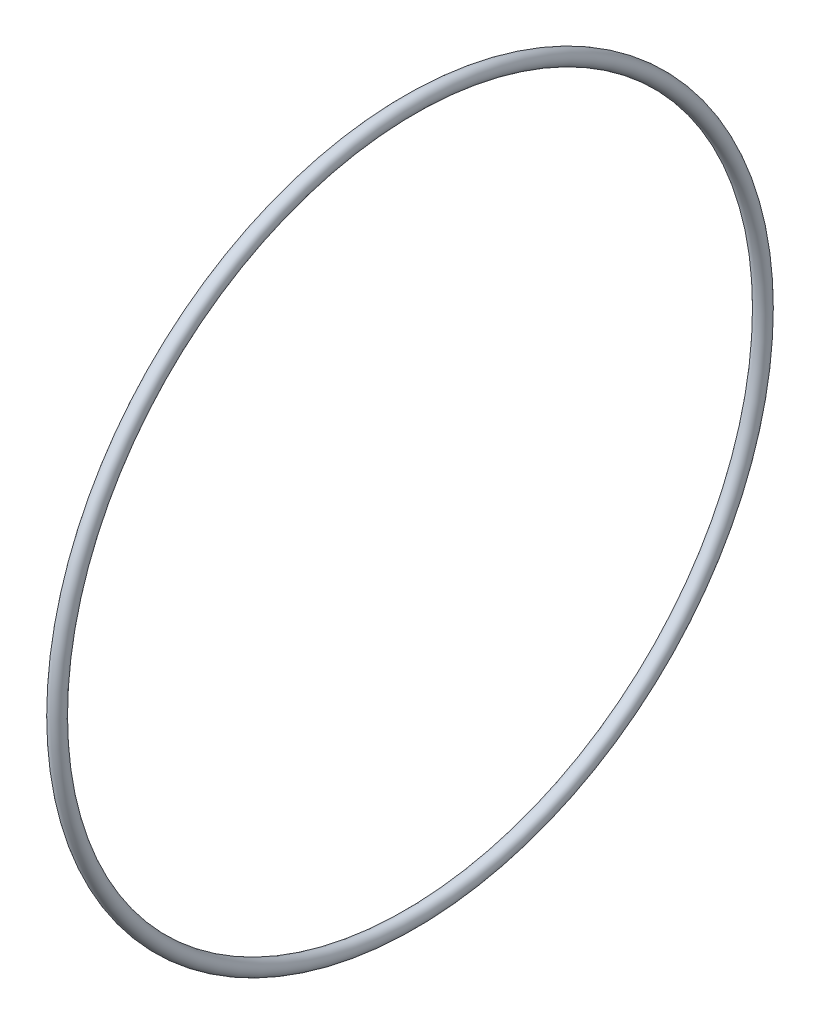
from build123d import *

# Parameters (mm, degrees)
ESQUISSE1_R = 0.35


with BuildPart() as part:
    # Esquisse1 → R_volution1 (revolve)
    with BuildSketch(Plane.XY, mode=Mode.PRIVATE) as r_volution1_sk:
        with Locations((0, 16.75)):
            Circle(ESQUISSE1_R)
    revolve(r_volution1_sk.sketch.rotate(Axis((0, 0, 0), (-1, 0, 0)), 90), axis=Axis((0, 0, 0), (-1, 0, 0)))


solid = part.part
